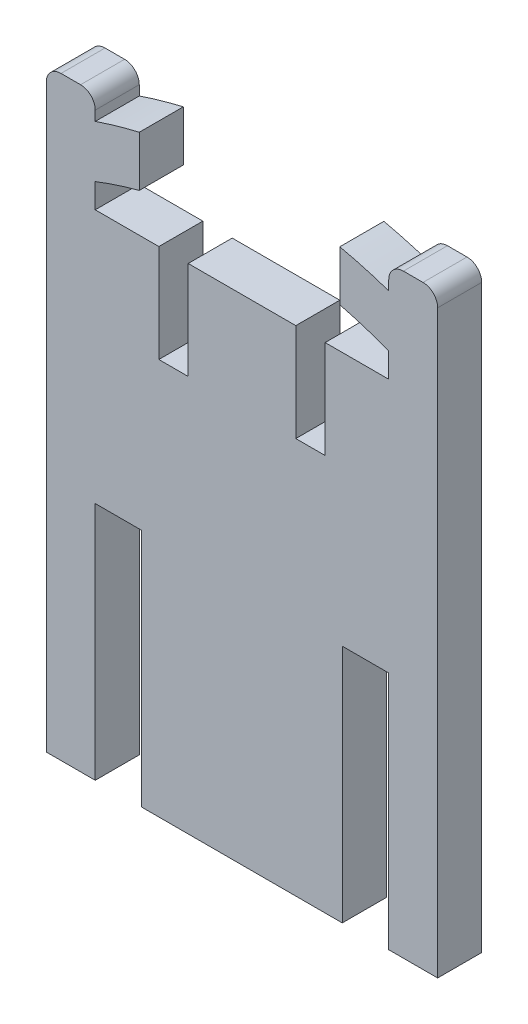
ISO-10303-21;
HEADER;
FILE_DESCRIPTION(('STEP AP214'),'2;1');
FILE_NAME('part.step','',(''),(''),'','','');
FILE_SCHEMA(('AUTOMOTIVE_DESIGN { 1 0 10303 214 1 1 1 1 }'));
ENDSEC;
DATA;
#1=APPLICATION_CONTEXT('core data for automotive mechanical design processes');
#2=APPLICATION_PROTOCOL_DEFINITION('international standard','automotive_design',2000,#1);
#3=PRODUCT_CONTEXT('',#1,'mechanical');
#4=PRODUCT('Part','Part','',(#3));
#5=PRODUCT_RELATED_PRODUCT_CATEGORY('part','',(#4));
#6=PRODUCT_DEFINITION_FORMATION('','',#4);
#7=PRODUCT_DEFINITION_CONTEXT('part definition',#1,'design');
#8=PRODUCT_DEFINITION('design','',#6,#7);
#9=PRODUCT_DEFINITION_SHAPE('','',#8);
#10=(LENGTH_UNIT() NAMED_UNIT(*) SI_UNIT(.MILLI.,.METRE.));
#11=(NAMED_UNIT(*) PLANE_ANGLE_UNIT() SI_UNIT($,.RADIAN.));
#12=(NAMED_UNIT(*) SI_UNIT($,.STERADIAN.) SOLID_ANGLE_UNIT());
#13=UNCERTAINTY_MEASURE_WITH_UNIT(LENGTH_MEASURE(1.E-05),#10,'distance_accuracy_value','');
#14=(GEOMETRIC_REPRESENTATION_CONTEXT(3) GLOBAL_UNCERTAINTY_ASSIGNED_CONTEXT((#13)) GLOBAL_UNIT_ASSIGNED_CONTEXT((#10,
#11,#12)) REPRESENTATION_CONTEXT('',''));
#15=CARTESIAN_POINT('',(0.,0.,0.));
#16=DIRECTION('',(0.,0.,1.));
#17=DIRECTION('',(1.,0.,0.));
#18=AXIS2_PLACEMENT_3D('',#15,#16,#17);
#19=CARTESIAN_POINT('',(0.,110.,9.));
#20=DIRECTION('',(0.,1.,0.));
#21=DIRECTION('',(0.,0.,1.));
#22=AXIS2_PLACEMENT_3D('',#19,#20,#21);
#23=PLANE('',#22);
#24=DIRECTION('',(0.,0.,-1.));
#25=VECTOR('',#24,1.);
#26=CARTESIAN_POINT('',(-11.,110.,10.));
#27=LINE('',#26,#25);
#28=CARTESIAN_POINT('',(-11.,110.,9.));
#29=VERTEX_POINT('',#28);
#30=CARTESIAN_POINT('',(-11.,110.,0.));
#31=VERTEX_POINT('',#30);
#32=EDGE_CURVE('E295',#29,#31,#27,.T.);
#33=ORIENTED_EDGE('',*,*,#32,.F.);
#34=DIRECTION('',(1.,0.,0.));
#35=VECTOR('',#34,1.);
#36=CARTESIAN_POINT('',(0.,110.,9.));
#37=LINE('',#36,#35);
#38=CARTESIAN_POINT('',(11.,110.,9.));
#39=VERTEX_POINT('',#38);
#40=EDGE_CURVE('E383',#29,#39,#37,.T.);
#41=ORIENTED_EDGE('',*,*,#40,.T.);
#42=DIRECTION('',(0.,0.,-1.));
#43=VECTOR('',#42,1.);
#44=CARTESIAN_POINT('',(11.,110.,10.));
#45=LINE('',#44,#43);
#46=CARTESIAN_POINT('',(11.,110.,0.));
#47=VERTEX_POINT('',#46);
#48=EDGE_CURVE('E314',#39,#47,#45,.T.);
#49=ORIENTED_EDGE('',*,*,#48,.T.);
#50=DIRECTION('',(1.,0.,0.));
#51=VECTOR('',#50,1.);
#52=CARTESIAN_POINT('',(0.,110.,0.));
#53=LINE('',#52,#51);
#54=EDGE_CURVE('E460',#31,#47,#53,.T.);
#55=ORIENTED_EDGE('',*,*,#54,.F.);
#56=EDGE_LOOP('',(#33,#41,#49,#55));
#57=FACE_BOUND('',#56,.T.);
#58=ADVANCED_FACE('F35',(#57),#23,.T.);
#59=DIRECTION('',(0.,0.,-1.));
#60=VECTOR('',#59,1.);
#61=CARTESIAN_POINT('',(17.,110.,10.));
#62=LINE('',#61,#60);
#63=CARTESIAN_POINT('',(17.,110.,9.));
#64=VERTEX_POINT('',#63);
#65=CARTESIAN_POINT('',(17.,110.,0.));
#66=VERTEX_POINT('',#65);
#67=EDGE_CURVE('E311',#64,#66,#62,.T.);
#68=ORIENTED_EDGE('',*,*,#67,.F.);
#69=CARTESIAN_POINT('',(30.,110.,9.));
#70=VERTEX_POINT('',#69);
#71=EDGE_CURVE('E378',#64,#70,#37,.T.);
#72=ORIENTED_EDGE('',*,*,#71,.T.);
#73=DIRECTION('',(0.,0.,-1.));
#74=VECTOR('',#73,1.);
#75=CARTESIAN_POINT('',(30.,110.,9.));
#76=LINE('',#75,#74);
#77=CARTESIAN_POINT('',(30.,110.,0.));
#78=VERTEX_POINT('',#77);
#79=EDGE_CURVE('E494',#70,#78,#76,.T.);
#80=ORIENTED_EDGE('',*,*,#79,.T.);
#81=EDGE_CURVE('E457',#66,#78,#53,.T.);
#82=ORIENTED_EDGE('',*,*,#81,.F.);
#83=EDGE_LOOP('',(#68,#72,#80,#82));
#84=FACE_BOUND('',#83,.T.);
#85=ADVANCED_FACE('F607',(#84),#23,.T.);
#86=CARTESIAN_POINT('',(-37.,127.647869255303,9.));
#87=DIRECTION('',(0.,0.,-1.));
#88=DIRECTION('',(-1.,0.,0.));
#89=AXIS2_PLACEMENT_3D('',#86,#87,#88);
#90=CYLINDRICAL_SURFACE('',#89,3.00000000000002);
#91=CARTESIAN_POINT('',(-37.,127.647869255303,0.));
#92=DIRECTION('',(0.,0.,1.));
#93=DIRECTION('',(1.,0.,0.));
#94=AXIS2_PLACEMENT_3D('',#91,#92,#93);
#95=CIRCLE('',#94,3.00000000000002);
#96=CARTESIAN_POINT('',(-40.,127.647869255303,0.));
#97=VERTEX_POINT('',#96);
#98=CARTESIAN_POINT('',(-37.,130.647869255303,0.));
#99=VERTEX_POINT('',#98);
#100=EDGE_CURVE('E325',#97,#99,#95,.F.);
#101=ORIENTED_EDGE('',*,*,#100,.F.);
#102=DIRECTION('',(0.,0.,-1.));
#103=VECTOR('',#102,1.);
#104=CARTESIAN_POINT('',(-40.,127.647869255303,9.));
#105=LINE('',#104,#103);
#106=CARTESIAN_POINT('',(-40.,127.647869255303,9.));
#107=VERTEX_POINT('',#106);
#108=EDGE_CURVE('E11',#107,#97,#105,.T.);
#109=ORIENTED_EDGE('',*,*,#108,.F.);
#110=CARTESIAN_POINT('',(-37.,127.647869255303,9.));
#111=DIRECTION('',(0.,0.,1.));
#112=DIRECTION('',(1.,0.,0.));
#113=AXIS2_PLACEMENT_3D('',#110,#111,#112);
#114=CIRCLE('',#113,3.00000000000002);
#115=CARTESIAN_POINT('',(-37.,130.647869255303,9.));
#116=VERTEX_POINT('',#115);
#117=EDGE_CURVE('E326',#107,#116,#114,.F.);
#118=ORIENTED_EDGE('',*,*,#117,.T.);
#119=DIRECTION('',(0.,0.,-1.));
#120=VECTOR('',#119,1.);
#121=CARTESIAN_POINT('',(-37.,130.647869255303,9.));
#122=LINE('',#121,#120);
#123=EDGE_CURVE('E402',#116,#99,#122,.T.);
#124=ORIENTED_EDGE('',*,*,#123,.T.);
#125=EDGE_LOOP('',(#101,#109,#118,#124));
#126=FACE_BOUND('',#125,.T.);
#127=ADVANCED_FACE('F37',(#126),#90,.T.);
#128=CARTESIAN_POINT('',(-40.,-43.5646212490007,9.));
#129=DIRECTION('',(-1.,0.,0.));
#130=DIRECTION('',(0.,0.,1.));
#131=AXIS2_PLACEMENT_3D('',#128,#129,#130);
#132=PLANE('',#131);
#133=DIRECTION('',(0.,1.,0.));
#134=VECTOR('',#133,1.);
#135=CARTESIAN_POINT('',(-40.,-43.5646212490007,0.));
#136=LINE('',#135,#134);
#137=CARTESIAN_POINT('',(-40.,8.99999999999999,0.));
#138=VERTEX_POINT('',#137);
#139=EDGE_CURVE('E405',#138,#97,#136,.T.);
#140=ORIENTED_EDGE('',*,*,#139,.F.);
#141=DIRECTION('',(0.,0.,-1.));
#142=VECTOR('',#141,1.);
#143=CARTESIAN_POINT('',(-40.,8.99999999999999,9.));
#144=LINE('',#143,#142);
#145=CARTESIAN_POINT('',(-40.,8.99999999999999,9.));
#146=VERTEX_POINT('',#145);
#147=EDGE_CURVE('E43',#146,#138,#144,.T.);
#148=ORIENTED_EDGE('',*,*,#147,.F.);
#149=DIRECTION('',(0.,1.,0.));
#150=VECTOR('',#149,1.);
#151=CARTESIAN_POINT('',(-40.,-43.5646212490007,9.));
#152=LINE('',#151,#150);
#153=EDGE_CURVE('E329',#146,#107,#152,.T.);
#154=ORIENTED_EDGE('',*,*,#153,.T.);
#155=ORIENTED_EDGE('',*,*,#108,.T.);
#156=EDGE_LOOP('',(#140,#148,#154,#155));
#157=FACE_BOUND('',#156,.T.);
#158=ADVANCED_FACE('F542',(#157),#132,.T.);
#159=CARTESIAN_POINT('',(0.,8.99999999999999,9.));
#160=DIRECTION('',(0.,-1.,0.));
#161=DIRECTION('',(0.,0.,-1.));
#162=AXIS2_PLACEMENT_3D('',#159,#160,#161);
#163=PLANE('',#162);
#164=DIRECTION('',(-1.,0.,0.));
#165=VECTOR('',#164,1.);
#166=CARTESIAN_POINT('',(0.,8.99999999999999,0.));
#167=LINE('',#166,#165);
#168=CARTESIAN_POINT('',(-30.,9.,0.));
#169=VERTEX_POINT('',#168);
#170=EDGE_CURVE('E408',#169,#138,#167,.T.);
#171=ORIENTED_EDGE('',*,*,#170,.F.);
#172=DIRECTION('',(0.,0.,-1.));
#173=VECTOR('',#172,1.);
#174=CARTESIAN_POINT('',(-30.,9.,9.));
#175=LINE('',#174,#173);
#176=CARTESIAN_POINT('',(-30.,9.,9.));
#177=VERTEX_POINT('',#176);
#178=EDGE_CURVE('E534',#177,#169,#175,.T.);
#179=ORIENTED_EDGE('',*,*,#178,.F.);
#180=DIRECTION('',(-1.,0.,0.));
#181=VECTOR('',#180,1.);
#182=CARTESIAN_POINT('',(0.,8.99999999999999,9.));
#183=LINE('',#182,#181);
#184=EDGE_CURVE('E333',#177,#146,#183,.T.);
#185=ORIENTED_EDGE('',*,*,#184,.T.);
#186=ORIENTED_EDGE('',*,*,#147,.T.);
#187=EDGE_LOOP('',(#171,#179,#185,#186));
#188=FACE_BOUND('',#187,.T.);
#189=ADVANCED_FACE('F538',(#188),#163,.T.);
#190=CARTESIAN_POINT('',(-30.,-43.5646212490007,9.));
#191=DIRECTION('',(-1.,0.,0.));
#192=DIRECTION('',(0.,0.,1.));
#193=AXIS2_PLACEMENT_3D('',#190,#191,#192);
#194=PLANE('',#193);
#195=DIRECTION('',(0.,1.,0.));
#196=VECTOR('',#195,1.);
#197=CARTESIAN_POINT('',(-30.,-43.5646212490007,0.));
#198=LINE('',#197,#196);
#199=CARTESIAN_POINT('',(-30.,58.,0.));
#200=VERTEX_POINT('',#199);
#201=EDGE_CURVE('E411',#169,#200,#198,.T.);
#202=ORIENTED_EDGE('',*,*,#201,.T.);
#203=DIRECTION('',(0.,0.,-1.));
#204=VECTOR('',#203,1.);
#205=CARTESIAN_POINT('',(-30.,58.,9.));
#206=LINE('',#205,#204);
#207=CARTESIAN_POINT('',(-30.,58.,9.));
#208=VERTEX_POINT('',#207);
#209=EDGE_CURVE('E531',#208,#200,#206,.T.);
#210=ORIENTED_EDGE('',*,*,#209,.F.);
#211=DIRECTION('',(0.,1.,0.));
#212=VECTOR('',#211,1.);
#213=CARTESIAN_POINT('',(-30.,-43.5646212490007,9.));
#214=LINE('',#213,#212);
#215=EDGE_CURVE('E336',#177,#208,#214,.T.);
#216=ORIENTED_EDGE('',*,*,#215,.F.);
#217=ORIENTED_EDGE('',*,*,#178,.T.);
#218=EDGE_LOOP('',(#202,#210,#216,#217));
#219=FACE_BOUND('',#218,.T.);
#220=ADVANCED_FACE('F549',(#219),#194,.F.);
#221=CARTESIAN_POINT('',(0.,58.,9.));
#222=DIRECTION('',(0.,1.,0.));
#223=DIRECTION('',(0.,0.,1.));
#224=AXIS2_PLACEMENT_3D('',#221,#222,#223);
#225=PLANE('',#224);
#226=DIRECTION('',(1.,0.,0.));
#227=VECTOR('',#226,1.);
#228=CARTESIAN_POINT('',(0.,58.,0.));
#229=LINE('',#228,#227);
#230=CARTESIAN_POINT('',(-20.5,58.,0.));
#231=VERTEX_POINT('',#230);
#232=EDGE_CURVE('E413',#200,#231,#229,.T.);
#233=ORIENTED_EDGE('',*,*,#232,.T.);
#234=DIRECTION('',(0.,0.,-1.));
#235=VECTOR('',#234,1.);
#236=CARTESIAN_POINT('',(-20.5,58.,9.));
#237=LINE('',#236,#235);
#238=CARTESIAN_POINT('',(-20.5,58.,9.));
#239=VERTEX_POINT('',#238);
#240=EDGE_CURVE('E528',#239,#231,#237,.T.);
#241=ORIENTED_EDGE('',*,*,#240,.F.);
#242=DIRECTION('',(1.,0.,0.));
#243=VECTOR('',#242,1.);
#244=CARTESIAN_POINT('',(0.,58.,9.));
#245=LINE('',#244,#243);
#246=EDGE_CURVE('E338',#208,#239,#245,.T.);
#247=ORIENTED_EDGE('',*,*,#246,.F.);
#248=ORIENTED_EDGE('',*,*,#209,.T.);
#249=EDGE_LOOP('',(#233,#241,#247,#248));
#250=FACE_BOUND('',#249,.T.);
#251=ADVANCED_FACE('F553',(#250),#225,.F.);
#252=CARTESIAN_POINT('',(-20.5,-43.5646212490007,9.));
#253=DIRECTION('',(1.,0.,0.));
#254=DIRECTION('',(0.,1.,0.));
#255=AXIS2_PLACEMENT_3D('',#252,#253,#254);
#256=PLANE('',#255);
#257=DIRECTION('',(0.,-1.,0.));
#258=VECTOR('',#257,1.);
#259=CARTESIAN_POINT('',(-20.5,-43.5646212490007,0.));
#260=LINE('',#259,#258);
#261=CARTESIAN_POINT('',(-20.5,8.99999999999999,0.));
#262=VERTEX_POINT('',#261);
#263=EDGE_CURVE('E415',#231,#262,#260,.T.);
#264=ORIENTED_EDGE('',*,*,#263,.T.);
#265=DIRECTION('',(0.,0.,-1.));
#266=VECTOR('',#265,1.);
#267=CARTESIAN_POINT('',(-20.5,8.99999999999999,9.));
#268=LINE('',#267,#266);
#269=CARTESIAN_POINT('',(-20.5,8.99999999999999,9.));
#270=VERTEX_POINT('',#269);
#271=EDGE_CURVE('E526',#270,#262,#268,.T.);
#272=ORIENTED_EDGE('',*,*,#271,.F.);
#273=DIRECTION('',(0.,-1.,0.));
#274=VECTOR('',#273,1.);
#275=CARTESIAN_POINT('',(-20.5,-43.5646212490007,9.));
#276=LINE('',#275,#274);
#277=EDGE_CURVE('E340',#239,#270,#276,.T.);
#278=ORIENTED_EDGE('',*,*,#277,.F.);
#279=ORIENTED_EDGE('',*,*,#240,.T.);
#280=EDGE_LOOP('',(#264,#272,#278,#279));
#281=FACE_BOUND('',#280,.T.);
#282=ADVANCED_FACE('F671',(#281),#256,.F.);
#283=CARTESIAN_POINT('',(0.,9.,9.));
#284=DIRECTION('',(0.,-1.,0.));
#285=DIRECTION('',(1.,0.,0.));
#286=AXIS2_PLACEMENT_3D('',#283,#284,#285);
#287=PLANE('',#286);
#288=DIRECTION('',(-1.,0.,0.));
#289=VECTOR('',#288,1.);
#290=CARTESIAN_POINT('',(0.,9.,0.));
#291=LINE('',#290,#289);
#292=CARTESIAN_POINT('',(20.5,9.,0.));
#293=VERTEX_POINT('',#292);
#294=EDGE_CURVE('E418',#293,#262,#291,.T.);
#295=ORIENTED_EDGE('',*,*,#294,.F.);
#296=DIRECTION('',(0.,0.,-1.));
#297=VECTOR('',#296,1.);
#298=CARTESIAN_POINT('',(20.5,9.,9.));
#299=LINE('',#298,#297);
#300=CARTESIAN_POINT('',(20.5,9.,9.));
#301=VERTEX_POINT('',#300);
#302=EDGE_CURVE('E524',#301,#293,#299,.T.);
#303=ORIENTED_EDGE('',*,*,#302,.F.);
#304=DIRECTION('',(-1.,0.,0.));
#305=VECTOR('',#304,1.);
#306=CARTESIAN_POINT('',(0.,9.,9.));
#307=LINE('',#306,#305);
#308=EDGE_CURVE('E342',#301,#270,#307,.T.);
#309=ORIENTED_EDGE('',*,*,#308,.T.);
#310=ORIENTED_EDGE('',*,*,#271,.T.);
#311=EDGE_LOOP('',(#295,#303,#309,#310));
#312=FACE_BOUND('',#311,.T.);
#313=ADVANCED_FACE('F669',(#312),#287,.T.);
#314=CARTESIAN_POINT('',(20.5,-43.5646212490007,9.));
#315=DIRECTION('',(1.,0.,0.));
#316=DIRECTION('',(0.,1.,0.));
#317=AXIS2_PLACEMENT_3D('',#314,#315,#316);
#318=PLANE('',#317);
#319=DIRECTION('',(0.,-1.,0.));
#320=VECTOR('',#319,1.);
#321=CARTESIAN_POINT('',(20.5,-43.5646212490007,0.));
#322=LINE('',#321,#320);
#323=CARTESIAN_POINT('',(20.5,58.,0.));
#324=VERTEX_POINT('',#323);
#325=EDGE_CURVE('E421',#324,#293,#322,.T.);
#326=ORIENTED_EDGE('',*,*,#325,.F.);
#327=DIRECTION('',(0.,0.,-1.));
#328=VECTOR('',#327,1.);
#329=CARTESIAN_POINT('',(20.5,58.,9.));
#330=LINE('',#329,#328);
#331=CARTESIAN_POINT('',(20.5,58.,9.));
#332=VERTEX_POINT('',#331);
#333=EDGE_CURVE('E522',#332,#324,#330,.T.);
#334=ORIENTED_EDGE('',*,*,#333,.F.);
#335=DIRECTION('',(0.,-1.,0.));
#336=VECTOR('',#335,1.);
#337=CARTESIAN_POINT('',(20.5,-43.5646212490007,9.));
#338=LINE('',#337,#336);
#339=EDGE_CURVE('E345',#332,#301,#338,.T.);
#340=ORIENTED_EDGE('',*,*,#339,.T.);
#341=ORIENTED_EDGE('',*,*,#302,.T.);
#342=EDGE_LOOP('',(#326,#334,#340,#341));
#343=FACE_BOUND('',#342,.T.);
#344=ADVANCED_FACE('F666',(#343),#318,.T.);
#345=CARTESIAN_POINT('',(0.,58.,9.));
#346=DIRECTION('',(0.,-1.,0.));
#347=DIRECTION('',(0.,0.,-1.));
#348=AXIS2_PLACEMENT_3D('',#345,#346,#347);
#349=PLANE('',#348);
#350=DIRECTION('',(-1.,0.,0.));
#351=VECTOR('',#350,1.);
#352=CARTESIAN_POINT('',(0.,58.,0.));
#353=LINE('',#352,#351);
#354=CARTESIAN_POINT('',(30.,58.,0.));
#355=VERTEX_POINT('',#354);
#356=EDGE_CURVE('E424',#355,#324,#353,.T.);
#357=ORIENTED_EDGE('',*,*,#356,.F.);
#358=DIRECTION('',(0.,0.,-1.));
#359=VECTOR('',#358,1.);
#360=CARTESIAN_POINT('',(30.,58.,9.));
#361=LINE('',#360,#359);
#362=CARTESIAN_POINT('',(30.,58.,9.));
#363=VERTEX_POINT('',#362);
#364=EDGE_CURVE('E520',#363,#355,#361,.T.);
#365=ORIENTED_EDGE('',*,*,#364,.F.);
#366=DIRECTION('',(-1.,0.,0.));
#367=VECTOR('',#366,1.);
#368=CARTESIAN_POINT('',(0.,58.,9.));
#369=LINE('',#368,#367);
#370=EDGE_CURVE('E348',#363,#332,#369,.T.);
#371=ORIENTED_EDGE('',*,*,#370,.T.);
#372=ORIENTED_EDGE('',*,*,#333,.T.);
#373=EDGE_LOOP('',(#357,#365,#371,#372));
#374=FACE_BOUND('',#373,.T.);
#375=ADVANCED_FACE('F662',(#374),#349,.T.);
#376=CARTESIAN_POINT('',(30.,-43.5646212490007,9.));
#377=DIRECTION('',(-1.,0.,0.));
#378=DIRECTION('',(0.,0.,1.));
#379=AXIS2_PLACEMENT_3D('',#376,#377,#378);
#380=PLANE('',#379);
#381=DIRECTION('',(0.,1.,0.));
#382=VECTOR('',#381,1.);
#383=CARTESIAN_POINT('',(30.,-43.5646212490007,0.));
#384=LINE('',#383,#382);
#385=CARTESIAN_POINT('',(30.,9.,0.));
#386=VERTEX_POINT('',#385);
#387=EDGE_CURVE('E427',#386,#355,#384,.T.);
#388=ORIENTED_EDGE('',*,*,#387,.F.);
#389=DIRECTION('',(0.,0.,-1.));
#390=VECTOR('',#389,1.);
#391=CARTESIAN_POINT('',(30.,9.,9.));
#392=LINE('',#391,#390);
#393=CARTESIAN_POINT('',(30.,9.,9.));
#394=VERTEX_POINT('',#393);
#395=EDGE_CURVE('E518',#394,#386,#392,.T.);
#396=ORIENTED_EDGE('',*,*,#395,.F.);
#397=DIRECTION('',(0.,1.,0.));
#398=VECTOR('',#397,1.);
#399=CARTESIAN_POINT('',(30.,-43.5646212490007,9.));
#400=LINE('',#399,#398);
#401=EDGE_CURVE('E351',#394,#363,#400,.T.);
#402=ORIENTED_EDGE('',*,*,#401,.T.);
#403=ORIENTED_EDGE('',*,*,#364,.T.);
#404=EDGE_LOOP('',(#388,#396,#402,#403));
#405=FACE_BOUND('',#404,.T.);
#406=ADVANCED_FACE('F656',(#405),#380,.T.);
#407=CARTESIAN_POINT('',(0.,9.,9.));
#408=DIRECTION('',(0.,1.,0.));
#409=DIRECTION('',(-1.,0.,0.));
#410=AXIS2_PLACEMENT_3D('',#407,#408,#409);
#411=PLANE('',#410);
#412=DIRECTION('',(1.,0.,0.));
#413=VECTOR('',#412,1.);
#414=CARTESIAN_POINT('',(0.,9.,0.));
#415=LINE('',#414,#413);
#416=CARTESIAN_POINT('',(40.,8.99999999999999,0.));
#417=VERTEX_POINT('',#416);
#418=EDGE_CURVE('E430',#386,#417,#415,.T.);
#419=ORIENTED_EDGE('',*,*,#418,.T.);
#420=DIRECTION('',(0.,0.,-1.));
#421=VECTOR('',#420,1.);
#422=CARTESIAN_POINT('',(40.,8.99999999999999,9.));
#423=LINE('',#422,#421);
#424=CARTESIAN_POINT('',(40.,8.99999999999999,9.));
#425=VERTEX_POINT('',#424);
#426=EDGE_CURVE('E515',#425,#417,#423,.T.);
#427=ORIENTED_EDGE('',*,*,#426,.F.);
#428=DIRECTION('',(1.,0.,0.));
#429=VECTOR('',#428,1.);
#430=CARTESIAN_POINT('',(0.,9.,9.));
#431=LINE('',#430,#429);
#432=EDGE_CURVE('E354',#394,#425,#431,.T.);
#433=ORIENTED_EDGE('',*,*,#432,.F.);
#434=ORIENTED_EDGE('',*,*,#395,.T.);
#435=EDGE_LOOP('',(#419,#427,#433,#434));
#436=FACE_BOUND('',#435,.T.);
#437=ADVANCED_FACE('F712',(#436),#411,.F.);
#438=CARTESIAN_POINT('',(40.,-43.5646212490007,9.));
#439=DIRECTION('',(-1.,0.,0.));
#440=DIRECTION('',(0.,0.,1.));
#441=AXIS2_PLACEMENT_3D('',#438,#439,#440);
#442=PLANE('',#441);
#443=DIRECTION('',(0.,1.,0.));
#444=VECTOR('',#443,1.);
#445=CARTESIAN_POINT('',(40.,-43.5646212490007,0.));
#446=LINE('',#445,#444);
#447=CARTESIAN_POINT('',(40.,127.647869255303,0.));
#448=VERTEX_POINT('',#447);
#449=EDGE_CURVE('E432',#417,#448,#446,.T.);
#450=ORIENTED_EDGE('',*,*,#449,.T.);
#451=DIRECTION('',(0.,0.,-1.));
#452=VECTOR('',#451,1.);
#453=CARTESIAN_POINT('',(40.,127.647869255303,9.));
#454=LINE('',#453,#452);
#455=CARTESIAN_POINT('',(40.,127.647869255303,9.));
#456=VERTEX_POINT('',#455);
#457=EDGE_CURVE('E513',#456,#448,#454,.T.);
#458=ORIENTED_EDGE('',*,*,#457,.F.);
#459=DIRECTION('',(0.,1.,0.));
#460=VECTOR('',#459,1.);
#461=CARTESIAN_POINT('',(40.,-43.5646212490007,9.));
#462=LINE('',#461,#460);
#463=EDGE_CURVE('E356',#425,#456,#462,.T.);
#464=ORIENTED_EDGE('',*,*,#463,.F.);
#465=ORIENTED_EDGE('',*,*,#426,.T.);
#466=EDGE_LOOP('',(#450,#458,#464,#465));
#467=FACE_BOUND('',#466,.T.);
#468=ADVANCED_FACE('F650',(#467),#442,.F.);
#469=CARTESIAN_POINT('',(37.,127.647869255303,9.));
#470=DIRECTION('',(0.,0.,-1.));
#471=DIRECTION('',(-1.,0.,0.));
#472=AXIS2_PLACEMENT_3D('',#469,#470,#471);
#473=CYLINDRICAL_SURFACE('',#472,3.00000000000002);
#474=CARTESIAN_POINT('',(37.,127.647869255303,0.));
#475=DIRECTION('',(0.,0.,1.));
#476=DIRECTION('',(1.,0.,0.));
#477=AXIS2_PLACEMENT_3D('',#474,#475,#476);
#478=CIRCLE('',#477,3.00000000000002);
#479=CARTESIAN_POINT('',(37.,130.647869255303,0.));
#480=VERTEX_POINT('',#479);
#481=EDGE_CURVE('E435',#480,#448,#478,.F.);
#482=ORIENTED_EDGE('',*,*,#481,.F.);
#483=DIRECTION('',(0.,0.,-1.));
#484=VECTOR('',#483,1.);
#485=CARTESIAN_POINT('',(37.,130.647869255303,9.));
#486=LINE('',#485,#484);
#487=CARTESIAN_POINT('',(37.,130.647869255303,9.));
#488=VERTEX_POINT('',#487);
#489=EDGE_CURVE('E511',#488,#480,#486,.T.);
#490=ORIENTED_EDGE('',*,*,#489,.F.);
#491=CARTESIAN_POINT('',(37.,127.647869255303,9.));
#492=DIRECTION('',(0.,0.,1.));
#493=DIRECTION('',(1.,0.,0.));
#494=AXIS2_PLACEMENT_3D('',#491,#492,#493);
#495=CIRCLE('',#494,3.00000000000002);
#496=EDGE_CURVE('E358',#488,#456,#495,.F.);
#497=ORIENTED_EDGE('',*,*,#496,.T.);
#498=ORIENTED_EDGE('',*,*,#457,.T.);
#499=EDGE_LOOP('',(#482,#490,#497,#498));
#500=FACE_BOUND('',#499,.T.);
#501=ADVANCED_FACE('F644',(#500),#473,.T.);
#502=CARTESIAN_POINT('',(-1.19745233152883E-12,130.647869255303,9.));
#503=DIRECTION('',(0.,-1.,0.));
#504=DIRECTION('',(1.,0.,0.));
#505=AXIS2_PLACEMENT_3D('',#502,#503,#504);
#506=PLANE('',#505);
#507=DIRECTION('',(-1.,0.,0.));
#508=VECTOR('',#507,1.);
#509=CARTESIAN_POINT('',(-1.19745233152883E-12,130.647869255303,0.));
#510=LINE('',#509,#508);
#511=CARTESIAN_POINT('',(33.,130.647869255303,0.));
#512=VERTEX_POINT('',#511);
#513=EDGE_CURVE('E438',#480,#512,#510,.T.);
#514=ORIENTED_EDGE('',*,*,#513,.T.);
#515=DIRECTION('',(0.,0.,-1.));
#516=VECTOR('',#515,1.);
#517=CARTESIAN_POINT('',(33.,130.647869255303,9.));
#518=LINE('',#517,#516);
#519=CARTESIAN_POINT('',(33.,130.647869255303,9.));
#520=VERTEX_POINT('',#519);
#521=EDGE_CURVE('E509',#520,#512,#518,.T.);
#522=ORIENTED_EDGE('',*,*,#521,.F.);
#523=DIRECTION('',(-1.,0.,0.));
#524=VECTOR('',#523,1.);
#525=CARTESIAN_POINT('',(-1.19745233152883E-12,130.647869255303,9.));
#526=LINE('',#525,#524);
#527=EDGE_CURVE('E361',#488,#520,#526,.T.);
#528=ORIENTED_EDGE('',*,*,#527,.F.);
#529=ORIENTED_EDGE('',*,*,#489,.T.);
#530=EDGE_LOOP('',(#514,#522,#528,#529));
#531=FACE_BOUND('',#530,.T.);
#532=ADVANCED_FACE('F705',(#531),#506,.F.);
#533=CARTESIAN_POINT('',(33.,127.647869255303,9.));
#534=DIRECTION('',(0.,0.,-1.));
#535=DIRECTION('',(-1.,0.,0.));
#536=AXIS2_PLACEMENT_3D('',#533,#534,#535);
#537=CYLINDRICAL_SURFACE('',#536,3.);
#538=CARTESIAN_POINT('',(33.,127.647869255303,0.));
#539=DIRECTION('',(0.,0.,1.));
#540=DIRECTION('',(1.,0.,0.));
#541=AXIS2_PLACEMENT_3D('',#538,#539,#540);
#542=CIRCLE('',#541,3.);
#543=CARTESIAN_POINT('',(30.,127.647869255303,0.));
#544=VERTEX_POINT('',#543);
#545=EDGE_CURVE('E441',#544,#512,#542,.F.);
#546=ORIENTED_EDGE('',*,*,#545,.F.);
#547=DIRECTION('',(0.,0.,-1.));
#548=VECTOR('',#547,1.);
#549=CARTESIAN_POINT('',(30.,127.647869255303,9.));
#550=LINE('',#549,#548);
#551=CARTESIAN_POINT('',(30.,127.647869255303,9.));
#552=VERTEX_POINT('',#551);
#553=EDGE_CURVE('E507',#552,#544,#550,.T.);
#554=ORIENTED_EDGE('',*,*,#553,.F.);
#555=CARTESIAN_POINT('',(33.,127.647869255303,9.));
#556=DIRECTION('',(0.,0.,1.));
#557=DIRECTION('',(1.,0.,0.));
#558=AXIS2_PLACEMENT_3D('',#555,#556,#557);
#559=CIRCLE('',#558,3.);
#560=EDGE_CURVE('E363',#552,#520,#559,.F.);
#561=ORIENTED_EDGE('',*,*,#560,.T.);
#562=ORIENTED_EDGE('',*,*,#521,.T.);
#563=EDGE_LOOP('',(#546,#554,#561,#562));
#564=FACE_BOUND('',#563,.T.);
#565=ADVANCED_FACE('F637',(#564),#537,.T.);
#566=CARTESIAN_POINT('',(30.,-43.5646212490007,9.));
#567=DIRECTION('',(1.,0.,0.));
#568=DIRECTION('',(0.,0.,-1.));
#569=AXIS2_PLACEMENT_3D('',#566,#567,#568);
#570=PLANE('',#569);
#571=DIRECTION('',(0.,-1.,0.));
#572=VECTOR('',#571,1.);
#573=CARTESIAN_POINT('',(30.,-43.5646212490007,0.));
#574=LINE('',#573,#572);
#575=CARTESIAN_POINT('',(30.,125.647869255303,0.));
#576=VERTEX_POINT('',#575);
#577=EDGE_CURVE('E444',#544,#576,#574,.T.);
#578=ORIENTED_EDGE('',*,*,#577,.T.);
#579=DIRECTION('',(0.,0.,-1.));
#580=VECTOR('',#579,1.);
#581=CARTESIAN_POINT('',(30.,125.647869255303,9.));
#582=LINE('',#581,#580);
#583=CARTESIAN_POINT('',(30.,125.647869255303,9.));
#584=VERTEX_POINT('',#583);
#585=EDGE_CURVE('E504',#584,#576,#582,.T.);
#586=ORIENTED_EDGE('',*,*,#585,.F.);
#587=DIRECTION('',(0.,-1.,0.));
#588=VECTOR('',#587,1.);
#589=CARTESIAN_POINT('',(30.,-43.5646212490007,9.));
#590=LINE('',#589,#588);
#591=EDGE_CURVE('E366',#552,#584,#590,.T.);
#592=ORIENTED_EDGE('',*,*,#591,.F.);
#593=ORIENTED_EDGE('',*,*,#553,.T.);
#594=EDGE_LOOP('',(#578,#586,#592,#593));
#595=FACE_BOUND('',#594,.T.);
#596=ADVANCED_FACE('F634',(#595),#570,.F.);
#597=CARTESIAN_POINT('',(0.,38.147869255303,9.));
#598=DIRECTION('',(0.,0.,-1.));
#599=DIRECTION('',(-1.,0.,0.));
#600=AXIS2_PLACEMENT_3D('',#597,#598,#599);
#601=CYLINDRICAL_SURFACE('',#600,92.5);
#602=CARTESIAN_POINT('',(0.,38.147869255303,0.));
#603=DIRECTION('',(0.,0.,1.));
#604=DIRECTION('',(1.,0.,0.));
#605=AXIS2_PLACEMENT_3D('',#602,#603,#604);
#606=CIRCLE('',#605,92.5);
#607=CARTESIAN_POINT('',(20.,128.459828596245,0.));
#608=VERTEX_POINT('',#607);
#609=EDGE_CURVE('E446',#576,#608,#606,.T.);
#610=ORIENTED_EDGE('',*,*,#609,.T.);
#611=DIRECTION('',(0.,0.,-1.));
#612=VECTOR('',#611,1.);
#613=CARTESIAN_POINT('',(20.,128.459828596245,9.));
#614=LINE('',#613,#612);
#615=CARTESIAN_POINT('',(20.,128.459828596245,9.));
#616=VERTEX_POINT('',#615);
#617=EDGE_CURVE('E501',#616,#608,#614,.T.);
#618=ORIENTED_EDGE('',*,*,#617,.F.);
#619=CARTESIAN_POINT('',(0.,38.147869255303,9.));
#620=DIRECTION('',(0.,0.,1.));
#621=DIRECTION('',(1.,0.,0.));
#622=AXIS2_PLACEMENT_3D('',#619,#620,#621);
#623=CIRCLE('',#622,92.5);
#624=EDGE_CURVE('E368',#584,#616,#623,.T.);
#625=ORIENTED_EDGE('',*,*,#624,.F.);
#626=ORIENTED_EDGE('',*,*,#585,.T.);
#627=EDGE_LOOP('',(#610,#618,#625,#626));
#628=FACE_BOUND('',#627,.T.);
#629=ADVANCED_FACE('F629',(#628),#601,.T.);
#630=CARTESIAN_POINT('',(20.0000000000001,-43.5646212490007,9.));
#631=DIRECTION('',(1.,0.,0.));
#632=DIRECTION('',(0.,1.,0.));
#633=AXIS2_PLACEMENT_3D('',#630,#631,#632);
#634=PLANE('',#633);
#635=DIRECTION('',(0.,-1.,0.));
#636=VECTOR('',#635,1.);
#637=CARTESIAN_POINT('',(20.0000000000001,-43.5646212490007,0.));
#638=LINE('',#637,#636);
#639=CARTESIAN_POINT('',(20.,118.186922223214,0.));
#640=VERTEX_POINT('',#639);
#641=EDGE_CURVE('E448',#608,#640,#638,.T.);
#642=ORIENTED_EDGE('',*,*,#641,.T.);
#643=DIRECTION('',(0.,0.,-1.));
#644=VECTOR('',#643,1.);
#645=CARTESIAN_POINT('',(20.,118.186922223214,9.));
#646=LINE('',#645,#644);
#647=CARTESIAN_POINT('',(20.,118.186922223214,9.));
#648=VERTEX_POINT('',#647);
#649=EDGE_CURVE('E499',#648,#640,#646,.T.);
#650=ORIENTED_EDGE('',*,*,#649,.F.);
#651=DIRECTION('',(0.,-1.,0.));
#652=VECTOR('',#651,1.);
#653=CARTESIAN_POINT('',(20.0000000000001,-43.5646212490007,9.));
#654=LINE('',#653,#652);
#655=EDGE_CURVE('E370',#616,#648,#654,.T.);
#656=ORIENTED_EDGE('',*,*,#655,.F.);
#657=ORIENTED_EDGE('',*,*,#617,.T.);
#658=EDGE_LOOP('',(#642,#650,#656,#657));
#659=FACE_BOUND('',#658,.T.);
#660=ADVANCED_FACE('F623',(#659),#634,.F.);
#661=CARTESIAN_POINT('',(0.,38.147869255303,9.));
#662=DIRECTION('',(0.,0.,-1.));
#663=DIRECTION('',(-1.,0.,0.));
#664=AXIS2_PLACEMENT_3D('',#661,#662,#663);
#665=CYLINDRICAL_SURFACE('',#664,82.5);
#666=CARTESIAN_POINT('',(0.,38.147869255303,0.));
#667=DIRECTION('',(0.,0.,1.));
#668=DIRECTION('',(1.,0.,0.));
#669=AXIS2_PLACEMENT_3D('',#666,#667,#668);
#670=CIRCLE('',#669,82.5);
#671=CARTESIAN_POINT('',(30.,115.,0.));
#672=VERTEX_POINT('',#671);
#673=EDGE_CURVE('E451',#672,#640,#670,.T.);
#674=ORIENTED_EDGE('',*,*,#673,.F.);
#675=DIRECTION('',(0.,0.,-1.));
#676=VECTOR('',#675,1.);
#677=CARTESIAN_POINT('',(30.,115.,9.));
#678=LINE('',#677,#676);
#679=CARTESIAN_POINT('',(30.,115.,9.));
#680=VERTEX_POINT('',#679);
#681=EDGE_CURVE('E497',#680,#672,#678,.T.);
#682=ORIENTED_EDGE('',*,*,#681,.F.);
#683=CARTESIAN_POINT('',(0.,38.147869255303,9.));
#684=DIRECTION('',(0.,0.,1.));
#685=DIRECTION('',(1.,0.,0.));
#686=AXIS2_PLACEMENT_3D('',#683,#684,#685);
#687=CIRCLE('',#686,82.5);
#688=EDGE_CURVE('E372',#680,#648,#687,.T.);
#689=ORIENTED_EDGE('',*,*,#688,.T.);
#690=ORIENTED_EDGE('',*,*,#649,.T.);
#691=EDGE_LOOP('',(#674,#682,#689,#690));
#692=FACE_BOUND('',#691,.T.);
#693=ADVANCED_FACE('F619',(#692),#665,.F.);
#694=CARTESIAN_POINT('',(29.9999999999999,-43.5646212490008,9.));
#695=DIRECTION('',(1.,0.,0.));
#696=DIRECTION('',(0.,1.,0.));
#697=AXIS2_PLACEMENT_3D('',#694,#695,#696);
#698=PLANE('',#697);
#699=DIRECTION('',(0.,-1.,0.));
#700=VECTOR('',#699,1.);
#701=CARTESIAN_POINT('',(29.9999999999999,-43.5646212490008,0.));
#702=LINE('',#701,#700);
#703=EDGE_CURVE('E454',#672,#78,#702,.T.);
#704=ORIENTED_EDGE('',*,*,#703,.T.);
#705=ORIENTED_EDGE('',*,*,#79,.F.);
#706=DIRECTION('',(0.,-1.,0.));
#707=VECTOR('',#706,1.);
#708=CARTESIAN_POINT('',(29.9999999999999,-43.5646212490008,9.));
#709=LINE('',#708,#707);
#710=EDGE_CURVE('E375',#680,#70,#709,.T.);
#711=ORIENTED_EDGE('',*,*,#710,.F.);
#712=ORIENTED_EDGE('',*,*,#681,.T.);
#713=EDGE_LOOP('',(#704,#705,#711,#712));
#714=FACE_BOUND('',#713,.T.);
#715=ADVANCED_FACE('F614',(#714),#698,.F.);
#716=DIRECTION('',(0.,0.,-1.));
#717=VECTOR('',#716,1.);
#718=CARTESIAN_POINT('',(-17.,110.,10.));
#719=LINE('',#718,#717);
#720=CARTESIAN_POINT('',(-17.,110.,9.));
#721=VERTEX_POINT('',#720);
#722=CARTESIAN_POINT('',(-17.,110.,0.));
#723=VERTEX_POINT('',#722);
#724=EDGE_CURVE('E278',#721,#723,#719,.T.);
#725=ORIENTED_EDGE('',*,*,#724,.T.);
#726=CARTESIAN_POINT('',(-30.,110.,0.));
#727=VERTEX_POINT('',#726);
#728=EDGE_CURVE('E290',#727,#723,#53,.T.);
#729=ORIENTED_EDGE('',*,*,#728,.F.);
#730=DIRECTION('',(0.,0.,-1.));
#731=VECTOR('',#730,1.);
#732=CARTESIAN_POINT('',(-30.,110.,9.));
#733=LINE('',#732,#731);
#734=CARTESIAN_POINT('',(-30.,110.,9.));
#735=VERTEX_POINT('',#734);
#736=EDGE_CURVE('E492',#735,#727,#733,.T.);
#737=ORIENTED_EDGE('',*,*,#736,.F.);
#738=EDGE_CURVE('E379',#735,#721,#37,.T.);
#739=ORIENTED_EDGE('',*,*,#738,.T.);
#740=EDGE_LOOP('',(#725,#729,#737,#739));
#741=FACE_BOUND('',#740,.T.);
#742=ADVANCED_FACE('F595',(#741),#23,.T.);
#743=CARTESIAN_POINT('',(-29.9999999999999,-43.5646212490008,9.));
#744=DIRECTION('',(1.,0.,0.));
#745=DIRECTION('',(0.,1.,0.));
#746=AXIS2_PLACEMENT_3D('',#743,#744,#745);
#747=PLANE('',#746);
#748=DIRECTION('',(0.,-1.,0.));
#749=VECTOR('',#748,1.);
#750=CARTESIAN_POINT('',(-29.9999999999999,-43.5646212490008,0.));
#751=LINE('',#750,#749);
#752=CARTESIAN_POINT('',(-30.,115.,0.));
#753=VERTEX_POINT('',#752);
#754=EDGE_CURVE('E459',#753,#727,#751,.T.);
#755=ORIENTED_EDGE('',*,*,#754,.F.);
#756=DIRECTION('',(0.,0.,-1.));
#757=VECTOR('',#756,1.);
#758=CARTESIAN_POINT('',(-30.,115.,9.));
#759=LINE('',#758,#757);
#760=CARTESIAN_POINT('',(-30.,115.,9.));
#761=VERTEX_POINT('',#760);
#762=EDGE_CURVE('E490',#761,#753,#759,.T.);
#763=ORIENTED_EDGE('',*,*,#762,.F.);
#764=DIRECTION('',(0.,-1.,0.));
#765=VECTOR('',#764,1.);
#766=CARTESIAN_POINT('',(-29.9999999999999,-43.5646212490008,9.));
#767=LINE('',#766,#765);
#768=EDGE_CURVE('E382',#761,#735,#767,.T.);
#769=ORIENTED_EDGE('',*,*,#768,.T.);
#770=ORIENTED_EDGE('',*,*,#736,.T.);
#771=EDGE_LOOP('',(#755,#763,#769,#770));
#772=FACE_BOUND('',#771,.T.);
#773=ADVANCED_FACE('F592',(#772),#747,.T.);
#774=CARTESIAN_POINT('',(0.,38.147869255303,9.));
#775=DIRECTION('',(0.,0.,-1.));
#776=DIRECTION('',(-1.,0.,0.));
#777=AXIS2_PLACEMENT_3D('',#774,#775,#776);
#778=CYLINDRICAL_SURFACE('',#777,82.5);
#779=CARTESIAN_POINT('',(0.,38.147869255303,0.));
#780=DIRECTION('',(0.,0.,1.));
#781=DIRECTION('',(1.,0.,0.));
#782=AXIS2_PLACEMENT_3D('',#779,#780,#781);
#783=CIRCLE('',#782,82.5);
#784=CARTESIAN_POINT('',(-21.,117.930386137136,0.));
#785=VERTEX_POINT('',#784);
#786=EDGE_CURVE('E462',#785,#753,#783,.T.);
#787=ORIENTED_EDGE('',*,*,#786,.F.);
#788=DIRECTION('',(0.,0.,-1.));
#789=VECTOR('',#788,1.);
#790=CARTESIAN_POINT('',(-21.,117.930386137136,9.));
#791=LINE('',#790,#789);
#792=CARTESIAN_POINT('',(-21.,117.930386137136,9.));
#793=VERTEX_POINT('',#792);
#794=EDGE_CURVE('E488',#793,#785,#791,.T.);
#795=ORIENTED_EDGE('',*,*,#794,.F.);
#796=CARTESIAN_POINT('',(0.,38.147869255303,9.));
#797=DIRECTION('',(0.,0.,1.));
#798=DIRECTION('',(1.,0.,0.));
#799=AXIS2_PLACEMENT_3D('',#796,#797,#798);
#800=CIRCLE('',#799,82.5);
#801=EDGE_CURVE('E386',#793,#761,#800,.T.);
#802=ORIENTED_EDGE('',*,*,#801,.T.);
#803=ORIENTED_EDGE('',*,*,#762,.T.);
#804=EDGE_LOOP('',(#787,#795,#802,#803));
#805=FACE_BOUND('',#804,.T.);
#806=ADVANCED_FACE('F588',(#805),#778,.F.);
#807=CARTESIAN_POINT('',(-21.,-43.5646212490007,9.));
#808=DIRECTION('',(-1.,0.,0.));
#809=DIRECTION('',(0.,0.,1.));
#810=AXIS2_PLACEMENT_3D('',#807,#808,#809);
#811=PLANE('',#810);
#812=DIRECTION('',(0.,1.,0.));
#813=VECTOR('',#812,1.);
#814=CARTESIAN_POINT('',(-21.,-43.5646212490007,0.));
#815=LINE('',#814,#813);
#816=CARTESIAN_POINT('',(-21.,128.232551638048,0.));
#817=VERTEX_POINT('',#816);
#818=EDGE_CURVE('E465',#785,#817,#815,.T.);
#819=ORIENTED_EDGE('',*,*,#818,.T.);
#820=DIRECTION('',(0.,0.,-1.));
#821=VECTOR('',#820,1.);
#822=CARTESIAN_POINT('',(-21.,128.232551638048,9.));
#823=LINE('',#822,#821);
#824=CARTESIAN_POINT('',(-21.,128.232551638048,9.));
#825=VERTEX_POINT('',#824);
#826=EDGE_CURVE('E485',#825,#817,#823,.T.);
#827=ORIENTED_EDGE('',*,*,#826,.F.);
#828=DIRECTION('',(0.,1.,0.));
#829=VECTOR('',#828,1.);
#830=CARTESIAN_POINT('',(-21.,-43.5646212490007,9.));
#831=LINE('',#830,#829);
#832=EDGE_CURVE('E389',#793,#825,#831,.T.);
#833=ORIENTED_EDGE('',*,*,#832,.F.);
#834=ORIENTED_EDGE('',*,*,#794,.T.);
#835=EDGE_LOOP('',(#819,#827,#833,#834));
#836=FACE_BOUND('',#835,.T.);
#837=ADVANCED_FACE('F584',(#836),#811,.F.);
#838=CARTESIAN_POINT('',(0.,38.147869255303,9.));
#839=DIRECTION('',(0.,0.,-1.));
#840=DIRECTION('',(-1.,0.,0.));
#841=AXIS2_PLACEMENT_3D('',#838,#839,#840);
#842=CYLINDRICAL_SURFACE('',#841,92.5);
#843=CARTESIAN_POINT('',(0.,38.147869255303,0.));
#844=DIRECTION('',(0.,0.,1.));
#845=DIRECTION('',(1.,0.,0.));
#846=AXIS2_PLACEMENT_3D('',#843,#844,#845);
#847=CIRCLE('',#846,92.5);
#848=CARTESIAN_POINT('',(-30.,125.647869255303,0.));
#849=VERTEX_POINT('',#848);
#850=EDGE_CURVE('E467',#817,#849,#847,.T.);
#851=ORIENTED_EDGE('',*,*,#850,.T.);
#852=DIRECTION('',(0.,0.,-1.));
#853=VECTOR('',#852,1.);
#854=CARTESIAN_POINT('',(-30.,125.647869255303,9.));
#855=LINE('',#854,#853);
#856=CARTESIAN_POINT('',(-30.,125.647869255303,9.));
#857=VERTEX_POINT('',#856);
#858=EDGE_CURVE('E483',#857,#849,#855,.T.);
#859=ORIENTED_EDGE('',*,*,#858,.F.);
#860=CARTESIAN_POINT('',(0.,38.147869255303,9.));
#861=DIRECTION('',(0.,0.,1.));
#862=DIRECTION('',(1.,0.,0.));
#863=AXIS2_PLACEMENT_3D('',#860,#861,#862);
#864=CIRCLE('',#863,92.5);
#865=EDGE_CURVE('E391',#825,#857,#864,.T.);
#866=ORIENTED_EDGE('',*,*,#865,.F.);
#867=ORIENTED_EDGE('',*,*,#826,.T.);
#868=EDGE_LOOP('',(#851,#859,#866,#867));
#869=FACE_BOUND('',#868,.T.);
#870=ADVANCED_FACE('F580',(#869),#842,.T.);
#871=CARTESIAN_POINT('',(-30.,-43.5646212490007,9.));
#872=DIRECTION('',(1.,0.,0.));
#873=DIRECTION('',(0.,0.,-1.));
#874=AXIS2_PLACEMENT_3D('',#871,#872,#873);
#875=PLANE('',#874);
#876=DIRECTION('',(0.,-1.,0.));
#877=VECTOR('',#876,1.);
#878=CARTESIAN_POINT('',(-30.,-43.5646212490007,0.));
#879=LINE('',#878,#877);
#880=CARTESIAN_POINT('',(-30.,127.647869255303,0.));
#881=VERTEX_POINT('',#880);
#882=EDGE_CURVE('E470',#881,#849,#879,.T.);
#883=ORIENTED_EDGE('',*,*,#882,.F.);
#884=DIRECTION('',(0.,0.,-1.));
#885=VECTOR('',#884,1.);
#886=CARTESIAN_POINT('',(-30.,127.647869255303,9.));
#887=LINE('',#886,#885);
#888=CARTESIAN_POINT('',(-30.,127.647869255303,9.));
#889=VERTEX_POINT('',#888);
#890=EDGE_CURVE('E481',#889,#881,#887,.T.);
#891=ORIENTED_EDGE('',*,*,#890,.F.);
#892=DIRECTION('',(0.,-1.,0.));
#893=VECTOR('',#892,1.);
#894=CARTESIAN_POINT('',(-30.,-43.5646212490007,9.));
#895=LINE('',#894,#893);
#896=EDGE_CURVE('E393',#889,#857,#895,.T.);
#897=ORIENTED_EDGE('',*,*,#896,.T.);
#898=ORIENTED_EDGE('',*,*,#858,.T.);
#899=EDGE_LOOP('',(#883,#891,#897,#898));
#900=FACE_BOUND('',#899,.T.);
#901=ADVANCED_FACE('F575',(#900),#875,.T.);
#902=CARTESIAN_POINT('',(-33.,127.647869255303,9.));
#903=DIRECTION('',(0.,0.,-1.));
#904=DIRECTION('',(-1.,0.,0.));
#905=AXIS2_PLACEMENT_3D('',#902,#903,#904);
#906=CYLINDRICAL_SURFACE('',#905,3.);
#907=CARTESIAN_POINT('',(-33.,127.647869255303,0.));
#908=DIRECTION('',(0.,0.,1.));
#909=DIRECTION('',(1.,0.,0.));
#910=AXIS2_PLACEMENT_3D('',#907,#908,#909);
#911=CIRCLE('',#910,3.);
#912=CARTESIAN_POINT('',(-33.,130.647869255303,0.));
#913=VERTEX_POINT('',#912);
#914=EDGE_CURVE('E473',#913,#881,#911,.F.);
#915=ORIENTED_EDGE('',*,*,#914,.F.);
#916=DIRECTION('',(0.,0.,-1.));
#917=VECTOR('',#916,1.);
#918=CARTESIAN_POINT('',(-33.,130.647869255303,9.));
#919=LINE('',#918,#917);
#920=CARTESIAN_POINT('',(-33.,130.647869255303,9.));
#921=VERTEX_POINT('',#920);
#922=EDGE_CURVE('E479',#921,#913,#919,.T.);
#923=ORIENTED_EDGE('',*,*,#922,.F.);
#924=CARTESIAN_POINT('',(-33.,127.647869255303,9.));
#925=DIRECTION('',(0.,0.,1.));
#926=DIRECTION('',(1.,0.,0.));
#927=AXIS2_PLACEMENT_3D('',#924,#925,#926);
#928=CIRCLE('',#927,3.);
#929=EDGE_CURVE('E396',#921,#889,#928,.F.);
#930=ORIENTED_EDGE('',*,*,#929,.T.);
#931=ORIENTED_EDGE('',*,*,#890,.T.);
#932=EDGE_LOOP('',(#915,#923,#930,#931));
#933=FACE_BOUND('',#932,.T.);
#934=ADVANCED_FACE('F570',(#933),#906,.T.);
#935=CARTESIAN_POINT('',(1.22023164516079E-12,130.647869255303,9.));
#936=DIRECTION('',(0.,1.,0.));
#937=DIRECTION('',(-1.,0.,0.));
#938=AXIS2_PLACEMENT_3D('',#935,#936,#937);
#939=PLANE('',#938);
#940=DIRECTION('',(1.,0.,0.));
#941=VECTOR('',#940,1.);
#942=CARTESIAN_POINT('',(1.22023164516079E-12,130.647869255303,0.));
#943=LINE('',#942,#941);
#944=EDGE_CURVE('E330',#99,#913,#943,.T.);
#945=ORIENTED_EDGE('',*,*,#944,.F.);
#946=ORIENTED_EDGE('',*,*,#123,.F.);
#947=DIRECTION('',(1.,0.,0.));
#948=VECTOR('',#947,1.);
#949=CARTESIAN_POINT('',(1.22023164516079E-12,130.647869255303,9.));
#950=LINE('',#949,#948);
#951=EDGE_CURVE('E399',#116,#921,#950,.T.);
#952=ORIENTED_EDGE('',*,*,#951,.T.);
#953=ORIENTED_EDGE('',*,*,#922,.T.);
#954=EDGE_LOOP('',(#945,#946,#952,#953));
#955=FACE_BOUND('',#954,.T.);
#956=ADVANCED_FACE('F567',(#955),#939,.T.);
#957=CARTESIAN_POINT('',(0.,-43.5646212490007,9.));
#958=DIRECTION('',(0.,0.,1.));
#959=DIRECTION('',(1.,0.,0.));
#960=AXIS2_PLACEMENT_3D('',#957,#958,#959);
#961=PLANE('',#960);
#962=DIRECTION('',(0.,1.,0.));
#963=VECTOR('',#962,1.);
#964=CARTESIAN_POINT('',(-11.,-43.5646212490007,9.));
#965=LINE('',#964,#963);
#966=CARTESIAN_POINT('',(-11.,90.,9.));
#967=VERTEX_POINT('',#966);
#968=EDGE_CURVE('E301',#967,#29,#965,.T.);
#969=ORIENTED_EDGE('',*,*,#968,.F.);
#970=DIRECTION('',(1.,0.,0.));
#971=VECTOR('',#970,1.);
#972=CARTESIAN_POINT('',(0.,90.,9.));
#973=LINE('',#972,#971);
#974=CARTESIAN_POINT('',(-17.,90.,9.));
#975=VERTEX_POINT('',#974);
#976=EDGE_CURVE('E297',#975,#967,#973,.T.);
#977=ORIENTED_EDGE('',*,*,#976,.F.);
#978=DIRECTION('',(0.,-1.,0.));
#979=VECTOR('',#978,1.);
#980=CARTESIAN_POINT('',(-17.,-43.5646212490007,9.));
#981=LINE('',#980,#979);
#982=EDGE_CURVE('E275',#721,#975,#981,.T.);
#983=ORIENTED_EDGE('',*,*,#982,.F.);
#984=ORIENTED_EDGE('',*,*,#738,.F.);
#985=ORIENTED_EDGE('',*,*,#768,.F.);
#986=ORIENTED_EDGE('',*,*,#801,.F.);
#987=ORIENTED_EDGE('',*,*,#832,.T.);
#988=ORIENTED_EDGE('',*,*,#865,.T.);
#989=ORIENTED_EDGE('',*,*,#896,.F.);
#990=ORIENTED_EDGE('',*,*,#929,.F.);
#991=ORIENTED_EDGE('',*,*,#951,.F.);
#992=ORIENTED_EDGE('',*,*,#117,.F.);
#993=ORIENTED_EDGE('',*,*,#153,.F.);
#994=ORIENTED_EDGE('',*,*,#184,.F.);
#995=ORIENTED_EDGE('',*,*,#215,.T.);
#996=ORIENTED_EDGE('',*,*,#246,.T.);
#997=ORIENTED_EDGE('',*,*,#277,.T.);
#998=ORIENTED_EDGE('',*,*,#308,.F.);
#999=ORIENTED_EDGE('',*,*,#339,.F.);
#1000=ORIENTED_EDGE('',*,*,#370,.F.);
#1001=ORIENTED_EDGE('',*,*,#401,.F.);
#1002=ORIENTED_EDGE('',*,*,#432,.T.);
#1003=ORIENTED_EDGE('',*,*,#463,.T.);
#1004=ORIENTED_EDGE('',*,*,#496,.F.);
#1005=ORIENTED_EDGE('',*,*,#527,.T.);
#1006=ORIENTED_EDGE('',*,*,#560,.F.);
#1007=ORIENTED_EDGE('',*,*,#591,.T.);
#1008=ORIENTED_EDGE('',*,*,#624,.T.);
#1009=ORIENTED_EDGE('',*,*,#655,.T.);
#1010=ORIENTED_EDGE('',*,*,#688,.F.);
#1011=ORIENTED_EDGE('',*,*,#710,.T.);
#1012=ORIENTED_EDGE('',*,*,#71,.F.);
#1013=DIRECTION('',(0.,1.,0.));
#1014=VECTOR('',#1013,1.);
#1015=CARTESIAN_POINT('',(17.,-43.5646212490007,9.));
#1016=LINE('',#1015,#1014);
#1017=CARTESIAN_POINT('',(17.,90.,9.));
#1018=VERTEX_POINT('',#1017);
#1019=EDGE_CURVE('E323',#1018,#64,#1016,.T.);
#1020=ORIENTED_EDGE('',*,*,#1019,.F.);
#1021=DIRECTION('',(1.,0.,0.));
#1022=VECTOR('',#1021,1.);
#1023=CARTESIAN_POINT('',(0.,90.,9.));
#1024=LINE('',#1023,#1022);
#1025=CARTESIAN_POINT('',(11.,90.,9.));
#1026=VERTEX_POINT('',#1025);
#1027=EDGE_CURVE('E313',#1026,#1018,#1024,.T.);
#1028=ORIENTED_EDGE('',*,*,#1027,.F.);
#1029=DIRECTION('',(0.,-1.,0.));
#1030=VECTOR('',#1029,1.);
#1031=CARTESIAN_POINT('',(11.,-43.5646212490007,9.));
#1032=LINE('',#1031,#1030);
#1033=EDGE_CURVE('E321',#39,#1026,#1032,.T.);
#1034=ORIENTED_EDGE('',*,*,#1033,.F.);
#1035=ORIENTED_EDGE('',*,*,#40,.F.);
#1036=EDGE_LOOP('',(#969,#977,#983,#984,#985,#986,#987,#988,#989,#990,#991,#992,#993,#994,#995,
#996,#997,#998,#999,#1000,#1001,#1002,#1003,#1004,#1005,#1006,#1007,#1008,#1009,#1010,#1011,
#1012,#1020,#1028,#1034,#1035));
#1037=FACE_BOUND('',#1036,.T.);
#1038=ADVANCED_FACE('F558',(#1037),#961,.T.);
#1039=CARTESIAN_POINT('',(0.,-43.5646212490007,0.));
#1040=DIRECTION('',(0.,0.,1.));
#1041=DIRECTION('',(1.,0.,0.));
#1042=AXIS2_PLACEMENT_3D('',#1039,#1040,#1041);
#1043=PLANE('',#1042);
#1044=DIRECTION('',(-1.,0.,0.));
#1045=VECTOR('',#1044,1.);
#1046=CARTESIAN_POINT('',(-11.,90.,0.));
#1047=LINE('',#1046,#1045);
#1048=CARTESIAN_POINT('',(-11.,90.,0.));
#1049=VERTEX_POINT('',#1048);
#1050=CARTESIAN_POINT('',(-17.,90.,0.));
#1051=VERTEX_POINT('',#1050);
#1052=EDGE_CURVE('E282',#1049,#1051,#1047,.T.);
#1053=ORIENTED_EDGE('',*,*,#1052,.F.);
#1054=DIRECTION('',(0.,-1.,0.));
#1055=VECTOR('',#1054,1.);
#1056=CARTESIAN_POINT('',(-11.,110.,0.));
#1057=LINE('',#1056,#1055);
#1058=EDGE_CURVE('E50',#31,#1049,#1057,.T.);
#1059=ORIENTED_EDGE('',*,*,#1058,.F.);
#1060=ORIENTED_EDGE('',*,*,#54,.T.);
#1061=DIRECTION('',(0.,1.,0.));
#1062=VECTOR('',#1061,1.);
#1063=CARTESIAN_POINT('',(11.,110.,0.));
#1064=LINE('',#1063,#1062);
#1065=CARTESIAN_POINT('',(11.,90.,0.));
#1066=VERTEX_POINT('',#1065);
#1067=EDGE_CURVE('E307',#1066,#47,#1064,.T.);
#1068=ORIENTED_EDGE('',*,*,#1067,.F.);
#1069=DIRECTION('',(-1.,0.,0.));
#1070=VECTOR('',#1069,1.);
#1071=CARTESIAN_POINT('',(17.,90.,0.));
#1072=LINE('',#1071,#1070);
#1073=CARTESIAN_POINT('',(17.,90.,0.));
#1074=VERTEX_POINT('',#1073);
#1075=EDGE_CURVE('E304',#1074,#1066,#1072,.T.);
#1076=ORIENTED_EDGE('',*,*,#1075,.F.);
#1077=DIRECTION('',(0.,-1.,0.));
#1078=VECTOR('',#1077,1.);
#1079=CARTESIAN_POINT('',(17.,110.,0.));
#1080=LINE('',#1079,#1078);
#1081=EDGE_CURVE('E58',#66,#1074,#1080,.T.);
#1082=ORIENTED_EDGE('',*,*,#1081,.F.);
#1083=ORIENTED_EDGE('',*,*,#81,.T.);
#1084=ORIENTED_EDGE('',*,*,#703,.F.);
#1085=ORIENTED_EDGE('',*,*,#673,.T.);
#1086=ORIENTED_EDGE('',*,*,#641,.F.);
#1087=ORIENTED_EDGE('',*,*,#609,.F.);
#1088=ORIENTED_EDGE('',*,*,#577,.F.);
#1089=ORIENTED_EDGE('',*,*,#545,.T.);
#1090=ORIENTED_EDGE('',*,*,#513,.F.);
#1091=ORIENTED_EDGE('',*,*,#481,.T.);
#1092=ORIENTED_EDGE('',*,*,#449,.F.);
#1093=ORIENTED_EDGE('',*,*,#418,.F.);
#1094=ORIENTED_EDGE('',*,*,#387,.T.);
#1095=ORIENTED_EDGE('',*,*,#356,.T.);
#1096=ORIENTED_EDGE('',*,*,#325,.T.);
#1097=ORIENTED_EDGE('',*,*,#294,.T.);
#1098=ORIENTED_EDGE('',*,*,#263,.F.);
#1099=ORIENTED_EDGE('',*,*,#232,.F.);
#1100=ORIENTED_EDGE('',*,*,#201,.F.);
#1101=ORIENTED_EDGE('',*,*,#170,.T.);
#1102=ORIENTED_EDGE('',*,*,#139,.T.);
#1103=ORIENTED_EDGE('',*,*,#100,.T.);
#1104=ORIENTED_EDGE('',*,*,#944,.T.);
#1105=ORIENTED_EDGE('',*,*,#914,.T.);
#1106=ORIENTED_EDGE('',*,*,#882,.T.);
#1107=ORIENTED_EDGE('',*,*,#850,.F.);
#1108=ORIENTED_EDGE('',*,*,#818,.F.);
#1109=ORIENTED_EDGE('',*,*,#786,.T.);
#1110=ORIENTED_EDGE('',*,*,#754,.T.);
#1111=ORIENTED_EDGE('',*,*,#728,.T.);
#1112=DIRECTION('',(0.,1.,0.));
#1113=VECTOR('',#1112,1.);
#1114=CARTESIAN_POINT('',(-17.,110.,0.));
#1115=LINE('',#1114,#1113);
#1116=EDGE_CURVE('E272',#1051,#723,#1115,.T.);
#1117=ORIENTED_EDGE('',*,*,#1116,.F.);
#1118=EDGE_LOOP('',(#1053,#1059,#1060,#1068,#1076,#1082,#1083,#1084,#1085,#1086,#1087,#1088,
#1089,#1090,#1091,#1092,#1093,#1094,#1095,#1096,#1097,#1098,#1099,#1100,#1101,#1102,#1103,#1104,
#1105,#1106,#1107,#1108,#1109,#1110,#1111,#1117));
#1119=FACE_BOUND('',#1118,.T.);
#1120=ADVANCED_FACE('F287',(#1119),#1043,.F.);
#1121=CARTESIAN_POINT('',(17.,110.,10.));
#1122=DIRECTION('',(1.,0.,0.));
#1123=DIRECTION('',(0.,1.,0.));
#1124=AXIS2_PLACEMENT_3D('',#1121,#1122,#1123);
#1125=PLANE('',#1124);
#1126=ORIENTED_EDGE('',*,*,#1019,.T.);
#1127=ORIENTED_EDGE('',*,*,#67,.T.);
#1128=ORIENTED_EDGE('',*,*,#1081,.T.);
#1129=DIRECTION('',(0.,0.,-1.));
#1130=VECTOR('',#1129,1.);
#1131=CARTESIAN_POINT('',(17.,90.,10.));
#1132=LINE('',#1131,#1130);
#1133=EDGE_CURVE('E310',#1018,#1074,#1132,.T.);
#1134=ORIENTED_EDGE('',*,*,#1133,.F.);
#1135=EDGE_LOOP('',(#1126,#1127,#1128,#1134));
#1136=FACE_BOUND('',#1135,.T.);
#1137=ADVANCED_FACE('F859',(#1136),#1125,.F.);
#1138=CARTESIAN_POINT('',(11.,110.,10.));
#1139=DIRECTION('',(-1.,0.,0.));
#1140=DIRECTION('',(0.,0.,1.));
#1141=AXIS2_PLACEMENT_3D('',#1138,#1139,#1140);
#1142=PLANE('',#1141);
#1143=ORIENTED_EDGE('',*,*,#1033,.T.);
#1144=DIRECTION('',(0.,0.,-1.));
#1145=VECTOR('',#1144,1.);
#1146=CARTESIAN_POINT('',(11.,90.,10.));
#1147=LINE('',#1146,#1145);
#1148=EDGE_CURVE('E317',#1026,#1066,#1147,.T.);
#1149=ORIENTED_EDGE('',*,*,#1148,.T.);
#1150=ORIENTED_EDGE('',*,*,#1067,.T.);
#1151=ORIENTED_EDGE('',*,*,#48,.F.);
#1152=EDGE_LOOP('',(#1143,#1149,#1150,#1151));
#1153=FACE_BOUND('',#1152,.T.);
#1154=ADVANCED_FACE('F867',(#1153),#1142,.F.);
#1155=CARTESIAN_POINT('',(17.,90.,10.));
#1156=DIRECTION('',(0.,-1.,0.));
#1157=DIRECTION('',(0.,0.,-1.));
#1158=AXIS2_PLACEMENT_3D('',#1155,#1156,#1157);
#1159=PLANE('',#1158);
#1160=ORIENTED_EDGE('',*,*,#1027,.T.);
#1161=ORIENTED_EDGE('',*,*,#1133,.T.);
#1162=ORIENTED_EDGE('',*,*,#1075,.T.);
#1163=ORIENTED_EDGE('',*,*,#1148,.F.);
#1164=EDGE_LOOP('',(#1160,#1161,#1162,#1163));
#1165=FACE_BOUND('',#1164,.T.);
#1166=ADVANCED_FACE('F876',(#1165),#1159,.F.);
#1167=CARTESIAN_POINT('',(-11.,110.,10.));
#1168=DIRECTION('',(1.,0.,0.));
#1169=DIRECTION('',(0.,1.,0.));
#1170=AXIS2_PLACEMENT_3D('',#1167,#1168,#1169);
#1171=PLANE('',#1170);
#1172=ORIENTED_EDGE('',*,*,#968,.T.);
#1173=ORIENTED_EDGE('',*,*,#32,.T.);
#1174=ORIENTED_EDGE('',*,*,#1058,.T.);
#1175=DIRECTION('',(0.,0.,-1.));
#1176=VECTOR('',#1175,1.);
#1177=CARTESIAN_POINT('',(-11.,90.,10.));
#1178=LINE('',#1177,#1176);
#1179=EDGE_CURVE('E279',#967,#1049,#1178,.T.);
#1180=ORIENTED_EDGE('',*,*,#1179,.F.);
#1181=EDGE_LOOP('',(#1172,#1173,#1174,#1180));
#1182=FACE_BOUND('',#1181,.T.);
#1183=ADVANCED_FACE('F597',(#1182),#1171,.F.);
#1184=CARTESIAN_POINT('',(-17.,110.,10.));
#1185=DIRECTION('',(-1.,0.,0.));
#1186=DIRECTION('',(0.,-1.,0.));
#1187=AXIS2_PLACEMENT_3D('',#1184,#1185,#1186);
#1188=PLANE('',#1187);
#1189=ORIENTED_EDGE('',*,*,#982,.T.);
#1190=DIRECTION('',(0.,0.,-1.));
#1191=VECTOR('',#1190,1.);
#1192=CARTESIAN_POINT('',(-17.,90.,10.));
#1193=LINE('',#1192,#1191);
#1194=EDGE_CURVE('E268',#975,#1051,#1193,.T.);
#1195=ORIENTED_EDGE('',*,*,#1194,.T.);
#1196=ORIENTED_EDGE('',*,*,#1116,.T.);
#1197=ORIENTED_EDGE('',*,*,#724,.F.);
#1198=EDGE_LOOP('',(#1189,#1195,#1196,#1197));
#1199=FACE_BOUND('',#1198,.T.);
#1200=ADVANCED_FACE('F270',(#1199),#1188,.F.);
#1201=CARTESIAN_POINT('',(-11.,90.,10.));
#1202=DIRECTION('',(0.,-1.,0.));
#1203=DIRECTION('',(0.,0.,-1.));
#1204=AXIS2_PLACEMENT_3D('',#1201,#1202,#1203);
#1205=PLANE('',#1204);
#1206=ORIENTED_EDGE('',*,*,#976,.T.);
#1207=ORIENTED_EDGE('',*,*,#1179,.T.);
#1208=ORIENTED_EDGE('',*,*,#1052,.T.);
#1209=ORIENTED_EDGE('',*,*,#1194,.F.);
#1210=EDGE_LOOP('',(#1206,#1207,#1208,#1209));
#1211=FACE_BOUND('',#1210,.T.);
#1212=ADVANCED_FACE('F283',(#1211),#1205,.F.);
#1213=CLOSED_SHELL('',(#58,#85,#127,#158,#189,#220,#251,#282,#313,#344,#375,#406,#437,#468,#501,
#532,#565,#596,#629,#660,#693,#715,#742,#773,#806,#837,#870,#901,#934,#956,#1038,#1120,#1137,
#1154,#1166,#1183,#1200,#1212));
#1214=MANIFOLD_SOLID_BREP('B2',#1213);
#1215=ADVANCED_BREP_SHAPE_REPRESENTATION('',(#18,#1214),#14);
#1216=SHAPE_DEFINITION_REPRESENTATION(#9,#1215);
ENDSEC;
END-ISO-10303-21;
